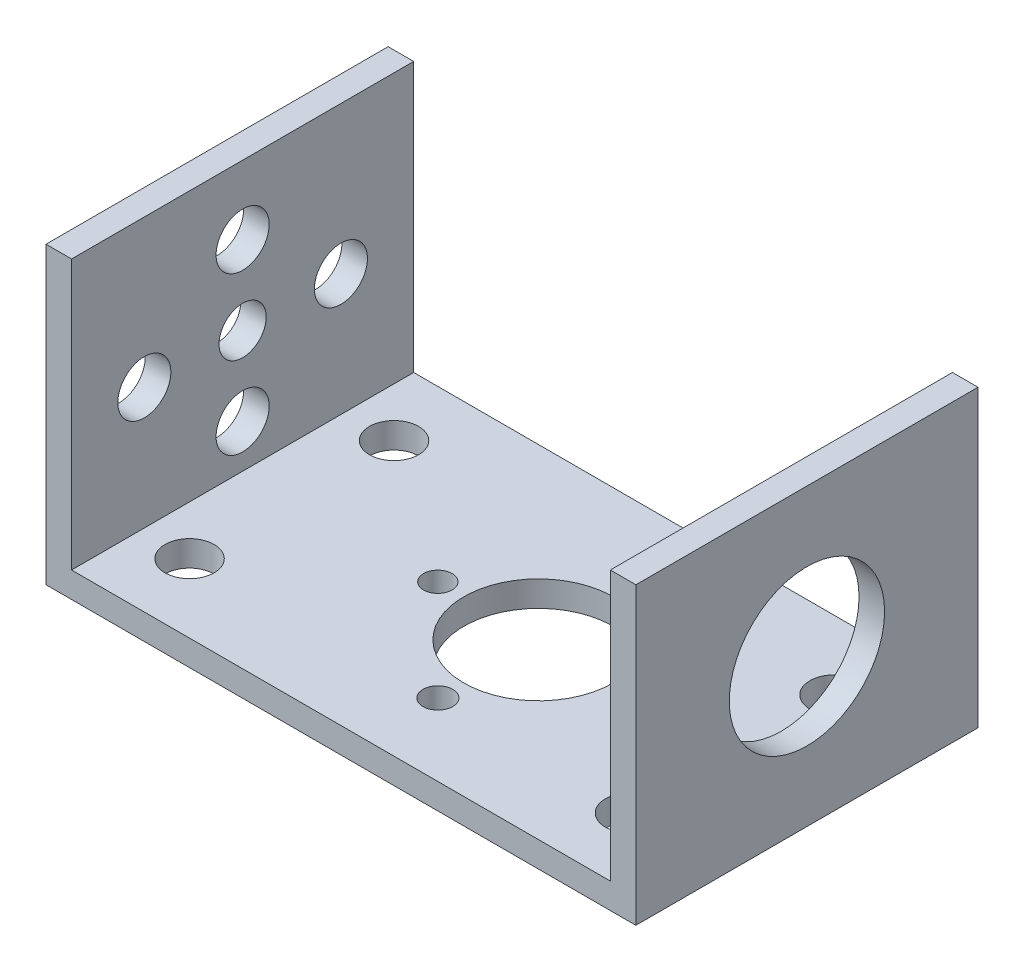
ISO-10303-21;
HEADER;
FILE_DESCRIPTION(('STEP AP214'),'2;1');
FILE_NAME('part.step','',(''),(''),'','','');
FILE_SCHEMA(('AUTOMOTIVE_DESIGN { 1 0 10303 214 1 1 1 1 }'));
ENDSEC;
DATA;
#1=APPLICATION_CONTEXT('core data for automotive mechanical design processes');
#2=APPLICATION_PROTOCOL_DEFINITION('international standard','automotive_design',2000,#1);
#3=PRODUCT_CONTEXT('',#1,'mechanical');
#4=PRODUCT('Part','Part','',(#3));
#5=PRODUCT_RELATED_PRODUCT_CATEGORY('part','',(#4));
#6=PRODUCT_DEFINITION_FORMATION('','',#4);
#7=PRODUCT_DEFINITION_CONTEXT('part definition',#1,'design');
#8=PRODUCT_DEFINITION('design','',#6,#7);
#9=PRODUCT_DEFINITION_SHAPE('','',#8);
#10=(LENGTH_UNIT() NAMED_UNIT(*) SI_UNIT(.MILLI.,.METRE.));
#11=(NAMED_UNIT(*) PLANE_ANGLE_UNIT() SI_UNIT($,.RADIAN.));
#12=(NAMED_UNIT(*) SI_UNIT($,.STERADIAN.) SOLID_ANGLE_UNIT());
#13=UNCERTAINTY_MEASURE_WITH_UNIT(LENGTH_MEASURE(1.E-05),#10,'distance_accuracy_value','');
#14=(GEOMETRIC_REPRESENTATION_CONTEXT(3) GLOBAL_UNCERTAINTY_ASSIGNED_CONTEXT((#13)) GLOBAL_UNIT_ASSIGNED_CONTEXT((#10,
#11,#12)) REPRESENTATION_CONTEXT('',''));
#15=CARTESIAN_POINT('',(0.,0.,0.));
#16=DIRECTION('',(0.,0.,1.));
#17=DIRECTION('',(1.,0.,0.));
#18=AXIS2_PLACEMENT_3D('',#15,#16,#17);
#19=CARTESIAN_POINT('',(-37.3660245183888,16.6367775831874,44.196));
#20=DIRECTION('',(0.,-1.,0.));
#21=DIRECTION('',(0.,0.,-1.));
#22=AXIS2_PLACEMENT_3D('',#19,#20,#21);
#23=PLANE('',#22);
#24=DIRECTION('',(-1.,0.,0.));
#25=VECTOR('',#24,1.);
#26=CARTESIAN_POINT('',(-37.3660245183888,16.6367775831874,0.));
#27=LINE('',#26,#25);
#28=CARTESIAN_POINT('',(-34.0640245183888,16.6367775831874,0.));
#29=VERTEX_POINT('',#28);
#30=CARTESIAN_POINT('',(-37.3660245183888,16.6367775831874,0.));
#31=VERTEX_POINT('',#30);
#32=EDGE_CURVE('E130',#29,#31,#27,.T.);
#33=ORIENTED_EDGE('',*,*,#32,.T.);
#34=DIRECTION('',(0.,0.,-1.));
#35=VECTOR('',#34,1.);
#36=CARTESIAN_POINT('',(-37.3660245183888,16.6367775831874,44.196));
#37=LINE('',#36,#35);
#38=CARTESIAN_POINT('',(-37.3660245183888,16.6367775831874,44.196));
#39=VERTEX_POINT('',#38);
#40=EDGE_CURVE('E11',#39,#31,#37,.T.);
#41=ORIENTED_EDGE('',*,*,#40,.F.);
#42=DIRECTION('',(-1.,0.,0.));
#43=VECTOR('',#42,1.);
#44=CARTESIAN_POINT('',(-37.3660245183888,16.6367775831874,44.196));
#45=LINE('',#44,#43);
#46=CARTESIAN_POINT('',(-34.0640245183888,16.6367775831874,44.196));
#47=VERTEX_POINT('',#46);
#48=EDGE_CURVE('E145',#47,#39,#45,.T.);
#49=ORIENTED_EDGE('',*,*,#48,.F.);
#50=DIRECTION('',(0.,0.,-1.));
#51=VECTOR('',#50,1.);
#52=CARTESIAN_POINT('',(-34.0640245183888,16.6367775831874,44.196));
#53=LINE('',#52,#51);
#54=EDGE_CURVE('E126',#47,#29,#53,.T.);
#55=ORIENTED_EDGE('',*,*,#54,.T.);
#56=EDGE_LOOP('',(#33,#41,#49,#55));
#57=FACE_BOUND('',#56,.T.);
#58=ADVANCED_FACE('F32',(#57),#23,.F.);
#59=CARTESIAN_POINT('',(-37.3660245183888,16.6367775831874,44.196));
#60=DIRECTION('',(1.,0.,0.));
#61=DIRECTION('',(0.,0.,-1.));
#62=AXIS2_PLACEMENT_3D('',#59,#60,#61);
#63=PLANE('',#62);
#64=CARTESIAN_POINT('',(-37.3660245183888,-2.41322241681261,9.398));
#65=DIRECTION('',(-1.,0.,0.));
#66=DIRECTION('',(0.,0.,1.));
#67=AXIS2_PLACEMENT_3D('',#64,#65,#66);
#68=CIRCLE('',#67,3.429);
#69=CARTESIAN_POINT('',(-37.3660245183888,-2.41322241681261,12.827));
#70=VERTEX_POINT('',#69);
#71=EDGE_CURVE('E183',#70,#70,#68,.T.);
#72=ORIENTED_EDGE('',*,*,#71,.F.);
#73=EDGE_LOOP('',(#72));
#74=FACE_BOUND('',#73,.T.);
#75=CARTESIAN_POINT('',(-37.3660245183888,-12.5732224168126,22.098));
#76=DIRECTION('',(-1.,0.,0.));
#77=DIRECTION('',(0.,0.,1.));
#78=AXIS2_PLACEMENT_3D('',#75,#76,#77);
#79=CIRCLE('',#78,3.429);
#80=CARTESIAN_POINT('',(-37.3660245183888,-12.5732224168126,25.527));
#81=VERTEX_POINT('',#80);
#82=EDGE_CURVE('E179',#81,#81,#79,.T.);
#83=ORIENTED_EDGE('',*,*,#82,.F.);
#84=EDGE_LOOP('',(#83));
#85=FACE_BOUND('',#84,.T.);
#86=CARTESIAN_POINT('',(-37.3660245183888,-2.41322241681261,34.798));
#87=DIRECTION('',(-1.,0.,0.));
#88=DIRECTION('',(0.,0.,1.));
#89=AXIS2_PLACEMENT_3D('',#86,#87,#88);
#90=CIRCLE('',#89,3.429);
#91=CARTESIAN_POINT('',(-37.3660245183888,-2.41322241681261,38.227));
#92=VERTEX_POINT('',#91);
#93=EDGE_CURVE('E175',#92,#92,#90,.T.);
#94=ORIENTED_EDGE('',*,*,#93,.F.);
#95=EDGE_LOOP('',(#94));
#96=FACE_BOUND('',#95,.T.);
#97=CARTESIAN_POINT('',(-37.3660245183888,7.74677758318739,22.098));
#98=DIRECTION('',(-1.,0.,0.));
#99=DIRECTION('',(0.,0.,1.));
#100=AXIS2_PLACEMENT_3D('',#97,#98,#99);
#101=CIRCLE('',#100,3.429);
#102=CARTESIAN_POINT('',(-37.3660245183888,7.74677758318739,25.527));
#103=VERTEX_POINT('',#102);
#104=EDGE_CURVE('E171',#103,#103,#101,.T.);
#105=ORIENTED_EDGE('',*,*,#104,.F.);
#106=EDGE_LOOP('',(#105));
#107=FACE_BOUND('',#106,.T.);
#108=CARTESIAN_POINT('',(-37.3660245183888,-2.41322241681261,22.098));
#109=DIRECTION('',(-1.,0.,0.));
#110=DIRECTION('',(0.,0.,1.));
#111=AXIS2_PLACEMENT_3D('',#108,#109,#110);
#112=CIRCLE('',#111,3.048);
#113=CARTESIAN_POINT('',(-37.3660245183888,-2.41322241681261,25.146));
#114=VERTEX_POINT('',#113);
#115=EDGE_CURVE('E163',#114,#114,#112,.T.);
#116=ORIENTED_EDGE('',*,*,#115,.F.);
#117=EDGE_LOOP('',(#116));
#118=FACE_BOUND('',#117,.T.);
#119=DIRECTION('',(0.,-1.,0.));
#120=VECTOR('',#119,1.);
#121=CARTESIAN_POINT('',(-37.3660245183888,16.6367775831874,0.));
#122=LINE('',#121,#120);
#123=CARTESIAN_POINT('',(-37.3660245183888,-21.4632224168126,0.));
#124=VERTEX_POINT('',#123);
#125=EDGE_CURVE('E133',#31,#124,#122,.T.);
#126=ORIENTED_EDGE('',*,*,#125,.T.);
#127=DIRECTION('',(0.,0.,-1.));
#128=VECTOR('',#127,1.);
#129=CARTESIAN_POINT('',(-37.3660245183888,-21.4632224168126,44.196));
#130=LINE('',#129,#128);
#131=CARTESIAN_POINT('',(-37.3660245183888,-21.4632224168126,44.196));
#132=VERTEX_POINT('',#131);
#133=EDGE_CURVE('E41',#132,#124,#130,.T.);
#134=ORIENTED_EDGE('',*,*,#133,.F.);
#135=DIRECTION('',(0.,-1.,0.));
#136=VECTOR('',#135,1.);
#137=CARTESIAN_POINT('',(-37.3660245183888,16.6367775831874,44.196));
#138=LINE('',#137,#136);
#139=EDGE_CURVE('E93',#39,#132,#138,.T.);
#140=ORIENTED_EDGE('',*,*,#139,.F.);
#141=ORIENTED_EDGE('',*,*,#40,.T.);
#142=EDGE_LOOP('',(#126,#134,#140,#141));
#143=FACE_BOUND('',#142,.T.);
#144=ADVANCED_FACE('F282',(#74,#85,#96,#107,#118,#143),#63,.F.);
#145=CARTESIAN_POINT('',(-37.3660245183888,-21.4632224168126,44.196));
#146=DIRECTION('',(0.,1.,0.));
#147=DIRECTION('',(-1.,0.,0.));
#148=AXIS2_PLACEMENT_3D('',#145,#146,#147);
#149=PLANE('',#148);
#150=CARTESIAN_POINT('',(3.90897548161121,-21.4632224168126,8.85107137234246));
#151=DIRECTION('',(0.,-1.,0.));
#152=DIRECTION('',(1.,0.,0.));
#153=AXIS2_PLACEMENT_3D('',#150,#151,#152);
#154=CIRCLE('',#153,1.65245260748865);
#155=CARTESIAN_POINT('',(5.56142808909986,-21.4632224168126,8.85107137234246));
#156=VERTEX_POINT('',#155);
#157=EDGE_CURVE('E204',#156,#156,#154,.T.);
#158=ORIENTED_EDGE('',*,*,#157,.F.);
#159=EDGE_LOOP('',(#158));
#160=FACE_BOUND('',#159,.T.);
#161=CARTESIAN_POINT('',(16.9089754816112,-21.4632224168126,21.8510713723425));
#162=DIRECTION('',(0.,-1.,0.));
#163=DIRECTION('',(1.,0.,0.));
#164=AXIS2_PLACEMENT_3D('',#161,#162,#163);
#165=CIRCLE('',#164,1.79902171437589);
#166=CARTESIAN_POINT('',(18.7079971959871,-21.4632224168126,21.8510713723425));
#167=VERTEX_POINT('',#166);
#168=EDGE_CURVE('E194',#167,#167,#165,.T.);
#169=ORIENTED_EDGE('',*,*,#168,.F.);
#170=EDGE_LOOP('',(#169));
#171=FACE_BOUND('',#170,.T.);
#172=CARTESIAN_POINT('',(3.90897548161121,-21.4632224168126,34.8510713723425));
#173=DIRECTION('',(0.,-1.,0.));
#174=DIRECTION('',(1.,0.,0.));
#175=AXIS2_PLACEMENT_3D('',#172,#173,#174);
#176=CIRCLE('',#175,1.92604116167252);
#177=CARTESIAN_POINT('',(5.83501664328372,-21.4632224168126,34.8510713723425));
#178=VERTEX_POINT('',#177);
#179=EDGE_CURVE('E191',#178,#178,#176,.T.);
#180=ORIENTED_EDGE('',*,*,#179,.F.);
#181=EDGE_LOOP('',(#180));
#182=FACE_BOUND('',#181,.T.);
#183=CARTESIAN_POINT('',(-9.09102451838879,-21.4632224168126,21.8510713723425));
#184=DIRECTION('',(0.,-1.,0.));
#185=DIRECTION('',(1.,0.,0.));
#186=AXIS2_PLACEMENT_3D('',#183,#184,#185);
#187=CIRCLE('',#186,1.84460575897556);
#188=CARTESIAN_POINT('',(-7.24641875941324,-21.4632224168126,21.8510713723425));
#189=VERTEX_POINT('',#188);
#190=EDGE_CURVE('E188',#189,#189,#187,.T.);
#191=ORIENTED_EDGE('',*,*,#190,.F.);
#192=EDGE_LOOP('',(#191));
#193=FACE_BOUND('',#192,.T.);
#194=CARTESIAN_POINT('',(-27.7140245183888,-21.4632224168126,35.306));
#195=DIRECTION('',(0.,1.,0.));
#196=DIRECTION('',(-1.,0.,0.));
#197=AXIS2_PLACEMENT_3D('',#194,#195,#196);
#198=CIRCLE('',#197,3.175);
#199=CARTESIAN_POINT('',(-30.8890245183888,-21.4632224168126,35.306));
#200=VERTEX_POINT('',#199);
#201=EDGE_CURVE('E211',#200,#200,#198,.T.);
#202=ORIENTED_EDGE('',*,*,#201,.T.);
#203=EDGE_LOOP('',(#202));
#204=FACE_BOUND('',#203,.T.);
#205=CARTESIAN_POINT('',(-27.7140245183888,-21.4632224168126,8.89));
#206=DIRECTION('',(0.,1.,0.));
#207=DIRECTION('',(-1.,0.,0.));
#208=AXIS2_PLACEMENT_3D('',#205,#206,#207);
#209=CIRCLE('',#208,3.175);
#210=CARTESIAN_POINT('',(-30.8890245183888,-21.4632224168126,8.89));
#211=VERTEX_POINT('',#210);
#212=EDGE_CURVE('E217',#211,#211,#209,.T.);
#213=ORIENTED_EDGE('',*,*,#212,.T.);
#214=EDGE_LOOP('',(#213));
#215=FACE_BOUND('',#214,.T.);
#216=CARTESIAN_POINT('',(29.1819754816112,-21.4632224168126,35.306));
#217=DIRECTION('',(0.,1.,0.));
#218=DIRECTION('',(-1.,0.,0.));
#219=AXIS2_PLACEMENT_3D('',#216,#217,#218);
#220=CIRCLE('',#219,3.175);
#221=CARTESIAN_POINT('',(26.0069754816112,-21.4632224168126,35.306));
#222=VERTEX_POINT('',#221);
#223=EDGE_CURVE('E223',#222,#222,#220,.T.);
#224=ORIENTED_EDGE('',*,*,#223,.T.);
#225=EDGE_LOOP('',(#224));
#226=FACE_BOUND('',#225,.T.);
#227=CARTESIAN_POINT('',(29.1819754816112,-21.4632224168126,8.89));
#228=DIRECTION('',(0.,1.,0.));
#229=DIRECTION('',(-1.,0.,0.));
#230=AXIS2_PLACEMENT_3D('',#227,#228,#229);
#231=CIRCLE('',#230,3.175);
#232=CARTESIAN_POINT('',(26.0069754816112,-21.4632224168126,8.89));
#233=VERTEX_POINT('',#232);
#234=EDGE_CURVE('E229',#233,#233,#231,.T.);
#235=ORIENTED_EDGE('',*,*,#234,.T.);
#236=EDGE_LOOP('',(#235));
#237=FACE_BOUND('',#236,.T.);
#238=CARTESIAN_POINT('',(3.90897548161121,-21.4632224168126,21.8510713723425));
#239=DIRECTION('',(0.,-1.,0.));
#240=DIRECTION('',(1.,0.,0.));
#241=AXIS2_PLACEMENT_3D('',#238,#239,#240);
#242=CIRCLE('',#241,9.65);
#243=CARTESIAN_POINT('',(13.5589754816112,-21.4632224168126,21.8510713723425));
#244=VERTEX_POINT('',#243);
#245=EDGE_CURVE('E159',#244,#244,#242,.T.);
#246=ORIENTED_EDGE('',*,*,#245,.F.);
#247=EDGE_LOOP('',(#246));
#248=FACE_BOUND('',#247,.T.);
#249=DIRECTION('',(1.,0.,0.));
#250=VECTOR('',#249,1.);
#251=CARTESIAN_POINT('',(-37.3660245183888,-21.4632224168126,0.));
#252=LINE('',#251,#250);
#253=CARTESIAN_POINT('',(38.8339754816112,-21.4632224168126,0.));
#254=VERTEX_POINT('',#253);
#255=EDGE_CURVE('E136',#124,#254,#252,.T.);
#256=ORIENTED_EDGE('',*,*,#255,.T.);
#257=DIRECTION('',(0.,0.,-1.));
#258=VECTOR('',#257,1.);
#259=CARTESIAN_POINT('',(38.8339754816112,-21.4632224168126,44.196));
#260=LINE('',#259,#258);
#261=CARTESIAN_POINT('',(38.8339754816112,-21.4632224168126,44.196));
#262=VERTEX_POINT('',#261);
#263=EDGE_CURVE('E152',#262,#254,#260,.T.);
#264=ORIENTED_EDGE('',*,*,#263,.F.);
#265=DIRECTION('',(1.,0.,0.));
#266=VECTOR('',#265,1.);
#267=CARTESIAN_POINT('',(-37.3660245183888,-21.4632224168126,44.196));
#268=LINE('',#267,#266);
#269=EDGE_CURVE('E248',#132,#262,#268,.T.);
#270=ORIENTED_EDGE('',*,*,#269,.F.);
#271=ORIENTED_EDGE('',*,*,#133,.T.);
#272=EDGE_LOOP('',(#256,#264,#270,#271));
#273=FACE_BOUND('',#272,.T.);
#274=ADVANCED_FACE('F286',(#160,#171,#182,#193,#204,#215,#226,#237,#248,#273),#149,.F.);
#275=CARTESIAN_POINT('',(38.8339754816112,-21.4632224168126,44.196));
#276=DIRECTION('',(-1.,0.,0.));
#277=DIRECTION('',(0.,0.,1.));
#278=AXIS2_PLACEMENT_3D('',#275,#276,#277);
#279=PLANE('',#278);
#280=CARTESIAN_POINT('',(38.8339754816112,-2.41322241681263,22.098));
#281=DIRECTION('',(1.,0.,0.));
#282=DIRECTION('',(0.,0.,-1.));
#283=AXIS2_PLACEMENT_3D('',#280,#281,#282);
#284=CIRCLE('',#283,10.033);
#285=CARTESIAN_POINT('',(38.8339754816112,-2.41322241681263,12.065));
#286=VERTEX_POINT('',#285);
#287=EDGE_CURVE('E167',#286,#286,#284,.T.);
#288=ORIENTED_EDGE('',*,*,#287,.F.);
#289=EDGE_LOOP('',(#288));
#290=FACE_BOUND('',#289,.T.);
#291=DIRECTION('',(0.,1.,0.));
#292=VECTOR('',#291,1.);
#293=CARTESIAN_POINT('',(38.8339754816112,-21.4632224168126,0.));
#294=LINE('',#293,#292);
#295=CARTESIAN_POINT('',(38.8339754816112,16.6367775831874,0.));
#296=VERTEX_POINT('',#295);
#297=EDGE_CURVE('E138',#254,#296,#294,.T.);
#298=ORIENTED_EDGE('',*,*,#297,.T.);
#299=DIRECTION('',(0.,0.,-1.));
#300=VECTOR('',#299,1.);
#301=CARTESIAN_POINT('',(38.8339754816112,16.6367775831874,44.196));
#302=LINE('',#301,#300);
#303=CARTESIAN_POINT('',(38.8339754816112,16.6367775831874,44.196));
#304=VERTEX_POINT('',#303);
#305=EDGE_CURVE('E149',#304,#296,#302,.T.);
#306=ORIENTED_EDGE('',*,*,#305,.F.);
#307=DIRECTION('',(0.,1.,0.));
#308=VECTOR('',#307,1.);
#309=CARTESIAN_POINT('',(38.8339754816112,-21.4632224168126,44.196));
#310=LINE('',#309,#308);
#311=EDGE_CURVE('E250',#262,#304,#310,.T.);
#312=ORIENTED_EDGE('',*,*,#311,.F.);
#313=ORIENTED_EDGE('',*,*,#263,.T.);
#314=EDGE_LOOP('',(#298,#306,#312,#313));
#315=FACE_BOUND('',#314,.T.);
#316=ADVANCED_FACE('F256',(#290,#315),#279,.F.);
#317=CARTESIAN_POINT('',(38.8339754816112,16.6367775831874,44.196));
#318=DIRECTION('',(0.,-1.,0.));
#319=DIRECTION('',(0.,0.,-1.));
#320=AXIS2_PLACEMENT_3D('',#317,#318,#319);
#321=PLANE('',#320);
#322=DIRECTION('',(-1.,0.,0.));
#323=VECTOR('',#322,1.);
#324=CARTESIAN_POINT('',(38.8339754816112,16.6367775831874,0.));
#325=LINE('',#324,#323);
#326=CARTESIAN_POINT('',(35.5319754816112,16.6367775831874,0.));
#327=VERTEX_POINT('',#326);
#328=EDGE_CURVE('E140',#296,#327,#325,.T.);
#329=ORIENTED_EDGE('',*,*,#328,.T.);
#330=DIRECTION('',(0.,0.,-1.));
#331=VECTOR('',#330,1.);
#332=CARTESIAN_POINT('',(35.5319754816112,16.6367775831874,44.196));
#333=LINE('',#332,#331);
#334=CARTESIAN_POINT('',(35.5319754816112,16.6367775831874,44.196));
#335=VERTEX_POINT('',#334);
#336=EDGE_CURVE('E121',#335,#327,#333,.T.);
#337=ORIENTED_EDGE('',*,*,#336,.F.);
#338=DIRECTION('',(-1.,0.,0.));
#339=VECTOR('',#338,1.);
#340=CARTESIAN_POINT('',(38.8339754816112,16.6367775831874,44.196));
#341=LINE('',#340,#339);
#342=EDGE_CURVE('E112',#304,#335,#341,.T.);
#343=ORIENTED_EDGE('',*,*,#342,.F.);
#344=ORIENTED_EDGE('',*,*,#305,.T.);
#345=EDGE_LOOP('',(#329,#337,#343,#344));
#346=FACE_BOUND('',#345,.T.);
#347=ADVANCED_FACE('F260',(#346),#321,.F.);
#348=CARTESIAN_POINT('',(35.5319754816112,16.6367775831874,44.196));
#349=DIRECTION('',(1.,0.,0.));
#350=DIRECTION('',(0.,1.,0.));
#351=AXIS2_PLACEMENT_3D('',#348,#349,#350);
#352=PLANE('',#351);
#353=CARTESIAN_POINT('',(35.5319754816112,-2.41322241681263,22.098));
#354=DIRECTION('',(1.,0.,0.));
#355=DIRECTION('',(0.,1.,0.));
#356=AXIS2_PLACEMENT_3D('',#353,#354,#355);
#357=CIRCLE('',#356,10.033);
#358=CARTESIAN_POINT('',(35.5319754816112,7.61977758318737,22.098));
#359=VERTEX_POINT('',#358);
#360=EDGE_CURVE('E164',#359,#359,#357,.T.);
#361=ORIENTED_EDGE('',*,*,#360,.T.);
#362=EDGE_LOOP('',(#361));
#363=FACE_BOUND('',#362,.T.);
#364=DIRECTION('',(0.,-1.,0.));
#365=VECTOR('',#364,1.);
#366=CARTESIAN_POINT('',(35.5319754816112,16.6367775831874,0.));
#367=LINE('',#366,#365);
#368=CARTESIAN_POINT('',(35.5319754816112,-18.1612224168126,0.));
#369=VERTEX_POINT('',#368);
#370=EDGE_CURVE('E120',#327,#369,#367,.T.);
#371=ORIENTED_EDGE('',*,*,#370,.T.);
#372=DIRECTION('',(0.,0.,-1.));
#373=VECTOR('',#372,1.);
#374=CARTESIAN_POINT('',(35.5319754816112,-18.1612224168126,44.196));
#375=LINE('',#374,#373);
#376=CARTESIAN_POINT('',(35.5319754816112,-18.1612224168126,44.196));
#377=VERTEX_POINT('',#376);
#378=EDGE_CURVE('E117',#377,#369,#375,.T.);
#379=ORIENTED_EDGE('',*,*,#378,.F.);
#380=DIRECTION('',(0.,-1.,0.));
#381=VECTOR('',#380,1.);
#382=CARTESIAN_POINT('',(35.5319754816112,16.6367775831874,44.196));
#383=LINE('',#382,#381);
#384=EDGE_CURVE('E106',#335,#377,#383,.T.);
#385=ORIENTED_EDGE('',*,*,#384,.F.);
#386=ORIENTED_EDGE('',*,*,#336,.T.);
#387=EDGE_LOOP('',(#371,#379,#385,#386));
#388=FACE_BOUND('',#387,.T.);
#389=ADVANCED_FACE('F118',(#363,#388),#352,.F.);
#390=CARTESIAN_POINT('',(-34.0640245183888,-18.1612224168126,44.196));
#391=DIRECTION('',(0.,-1.,0.));
#392=DIRECTION('',(1.,0.,0.));
#393=AXIS2_PLACEMENT_3D('',#390,#391,#392);
#394=PLANE('',#393);
#395=CARTESIAN_POINT('',(3.90897548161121,-18.1612224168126,8.85107137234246));
#396=DIRECTION('',(0.,-1.,0.));
#397=DIRECTION('',(1.,0.,0.));
#398=AXIS2_PLACEMENT_3D('',#395,#396,#397);
#399=CIRCLE('',#398,1.65245260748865);
#400=CARTESIAN_POINT('',(5.56142808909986,-18.1612224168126,8.85107137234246));
#401=VERTEX_POINT('',#400);
#402=EDGE_CURVE('E35',#401,#401,#399,.T.);
#403=ORIENTED_EDGE('',*,*,#402,.T.);
#404=EDGE_LOOP('',(#403));
#405=FACE_BOUND('',#404,.T.);
#406=CARTESIAN_POINT('',(16.9089754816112,-18.1612224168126,21.8510713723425));
#407=DIRECTION('',(0.,-1.,0.));
#408=DIRECTION('',(1.,0.,0.));
#409=AXIS2_PLACEMENT_3D('',#406,#407,#408);
#410=CIRCLE('',#409,1.79902171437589);
#411=CARTESIAN_POINT('',(18.7079971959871,-18.1612224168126,21.8510713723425));
#412=VERTEX_POINT('',#411);
#413=EDGE_CURVE('E192',#412,#412,#410,.T.);
#414=ORIENTED_EDGE('',*,*,#413,.T.);
#415=EDGE_LOOP('',(#414));
#416=FACE_BOUND('',#415,.T.);
#417=CARTESIAN_POINT('',(3.90897548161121,-18.1612224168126,34.8510713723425));
#418=DIRECTION('',(0.,-1.,0.));
#419=DIRECTION('',(1.,0.,0.));
#420=AXIS2_PLACEMENT_3D('',#417,#418,#419);
#421=CIRCLE('',#420,1.92604116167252);
#422=CARTESIAN_POINT('',(5.83501664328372,-18.1612224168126,34.8510713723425));
#423=VERTEX_POINT('',#422);
#424=EDGE_CURVE('E189',#423,#423,#421,.T.);
#425=ORIENTED_EDGE('',*,*,#424,.T.);
#426=EDGE_LOOP('',(#425));
#427=FACE_BOUND('',#426,.T.);
#428=CARTESIAN_POINT('',(-9.09102451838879,-18.1612224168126,21.8510713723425));
#429=DIRECTION('',(0.,-1.,0.));
#430=DIRECTION('',(1.,0.,0.));
#431=AXIS2_PLACEMENT_3D('',#428,#429,#430);
#432=CIRCLE('',#431,1.84460575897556);
#433=CARTESIAN_POINT('',(-7.24641875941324,-18.1612224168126,21.8510713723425));
#434=VERTEX_POINT('',#433);
#435=EDGE_CURVE('E184',#434,#434,#432,.T.);
#436=ORIENTED_EDGE('',*,*,#435,.T.);
#437=EDGE_LOOP('',(#436));
#438=FACE_BOUND('',#437,.T.);
#439=CARTESIAN_POINT('',(-27.7140245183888,-18.1612224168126,35.306));
#440=DIRECTION('',(0.,1.,0.));
#441=DIRECTION('',(-1.,0.,0.));
#442=AXIS2_PLACEMENT_3D('',#439,#440,#441);
#443=CIRCLE('',#442,3.175);
#444=CARTESIAN_POINT('',(-30.8890245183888,-18.1612224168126,35.306));
#445=VERTEX_POINT('',#444);
#446=EDGE_CURVE('E187',#445,#445,#443,.T.);
#447=ORIENTED_EDGE('',*,*,#446,.F.);
#448=EDGE_LOOP('',(#447));
#449=FACE_BOUND('',#448,.T.);
#450=CARTESIAN_POINT('',(-27.7140245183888,-18.1612224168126,8.89));
#451=DIRECTION('',(0.,1.,0.));
#452=DIRECTION('',(-1.,0.,0.));
#453=AXIS2_PLACEMENT_3D('',#450,#451,#452);
#454=CIRCLE('',#453,3.175);
#455=CARTESIAN_POINT('',(-30.8890245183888,-18.1612224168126,8.89));
#456=VERTEX_POINT('',#455);
#457=EDGE_CURVE('E214',#456,#456,#454,.T.);
#458=ORIENTED_EDGE('',*,*,#457,.F.);
#459=EDGE_LOOP('',(#458));
#460=FACE_BOUND('',#459,.T.);
#461=CARTESIAN_POINT('',(29.1819754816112,-18.1612224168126,35.306));
#462=DIRECTION('',(0.,1.,0.));
#463=DIRECTION('',(-1.,0.,0.));
#464=AXIS2_PLACEMENT_3D('',#461,#462,#463);
#465=CIRCLE('',#464,3.175);
#466=CARTESIAN_POINT('',(26.0069754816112,-18.1612224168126,35.306));
#467=VERTEX_POINT('',#466);
#468=EDGE_CURVE('E220',#467,#467,#465,.T.);
#469=ORIENTED_EDGE('',*,*,#468,.F.);
#470=EDGE_LOOP('',(#469));
#471=FACE_BOUND('',#470,.T.);
#472=CARTESIAN_POINT('',(29.1819754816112,-18.1612224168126,8.89));
#473=DIRECTION('',(0.,1.,0.));
#474=DIRECTION('',(-1.,0.,0.));
#475=AXIS2_PLACEMENT_3D('',#472,#473,#474);
#476=CIRCLE('',#475,3.175);
#477=CARTESIAN_POINT('',(26.0069754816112,-18.1612224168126,8.89));
#478=VERTEX_POINT('',#477);
#479=EDGE_CURVE('E226',#478,#478,#476,.T.);
#480=ORIENTED_EDGE('',*,*,#479,.F.);
#481=EDGE_LOOP('',(#480));
#482=FACE_BOUND('',#481,.T.);
#483=CARTESIAN_POINT('',(3.90897548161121,-18.1612224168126,21.8510713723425));
#484=DIRECTION('',(0.,-1.,0.));
#485=DIRECTION('',(1.,0.,0.));
#486=AXIS2_PLACEMENT_3D('',#483,#484,#485);
#487=CIRCLE('',#486,9.65);
#488=CARTESIAN_POINT('',(13.5589754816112,-18.1612224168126,21.8510713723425));
#489=VERTEX_POINT('',#488);
#490=EDGE_CURVE('E134',#489,#489,#487,.T.);
#491=ORIENTED_EDGE('',*,*,#490,.T.);
#492=EDGE_LOOP('',(#491));
#493=FACE_BOUND('',#492,.T.);
#494=DIRECTION('',(-1.,0.,0.));
#495=VECTOR('',#494,1.);
#496=CARTESIAN_POINT('',(-34.0640245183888,-18.1612224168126,0.));
#497=LINE('',#496,#495);
#498=CARTESIAN_POINT('',(-34.0640245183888,-18.1612224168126,0.));
#499=VERTEX_POINT('',#498);
#500=EDGE_CURVE('E79',#369,#499,#497,.T.);
#501=ORIENTED_EDGE('',*,*,#500,.T.);
#502=DIRECTION('',(0.,0.,-1.));
#503=VECTOR('',#502,1.);
#504=CARTESIAN_POINT('',(-34.0640245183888,-18.1612224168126,44.196));
#505=LINE('',#504,#503);
#506=CARTESIAN_POINT('',(-34.0640245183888,-18.1612224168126,44.196));
#507=VERTEX_POINT('',#506);
#508=EDGE_CURVE('E122',#507,#499,#505,.T.);
#509=ORIENTED_EDGE('',*,*,#508,.F.);
#510=DIRECTION('',(-1.,0.,0.));
#511=VECTOR('',#510,1.);
#512=CARTESIAN_POINT('',(-34.0640245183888,-18.1612224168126,44.196));
#513=LINE('',#512,#511);
#514=EDGE_CURVE('E110',#377,#507,#513,.T.);
#515=ORIENTED_EDGE('',*,*,#514,.F.);
#516=ORIENTED_EDGE('',*,*,#378,.T.);
#517=EDGE_LOOP('',(#501,#509,#515,#516));
#518=FACE_BOUND('',#517,.T.);
#519=ADVANCED_FACE('F124',(#405,#416,#427,#438,#449,#460,#471,#482,#493,#518),#394,.F.);
#520=CARTESIAN_POINT('',(-34.0640245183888,16.6367775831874,44.196));
#521=DIRECTION('',(-1.,0.,0.));
#522=DIRECTION('',(0.,-1.,0.));
#523=AXIS2_PLACEMENT_3D('',#520,#521,#522);
#524=PLANE('',#523);
#525=CARTESIAN_POINT('',(-34.0640245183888,-2.41322241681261,9.398));
#526=DIRECTION('',(-1.,0.,0.));
#527=DIRECTION('',(0.,-1.,0.));
#528=AXIS2_PLACEMENT_3D('',#525,#526,#527);
#529=CIRCLE('',#528,3.429);
#530=CARTESIAN_POINT('',(-34.0640245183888,-5.84222241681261,9.398));
#531=VERTEX_POINT('',#530);
#532=EDGE_CURVE('E180',#531,#531,#529,.T.);
#533=ORIENTED_EDGE('',*,*,#532,.T.);
#534=EDGE_LOOP('',(#533));
#535=FACE_BOUND('',#534,.T.);
#536=CARTESIAN_POINT('',(-34.0640245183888,-12.5732224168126,22.098));
#537=DIRECTION('',(-1.,0.,0.));
#538=DIRECTION('',(0.,-1.,0.));
#539=AXIS2_PLACEMENT_3D('',#536,#537,#538);
#540=CIRCLE('',#539,3.429);
#541=CARTESIAN_POINT('',(-34.0640245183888,-16.0022224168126,22.098));
#542=VERTEX_POINT('',#541);
#543=EDGE_CURVE('E176',#542,#542,#540,.T.);
#544=ORIENTED_EDGE('',*,*,#543,.T.);
#545=EDGE_LOOP('',(#544));
#546=FACE_BOUND('',#545,.T.);
#547=CARTESIAN_POINT('',(-34.0640245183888,-2.41322241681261,34.798));
#548=DIRECTION('',(-1.,0.,0.));
#549=DIRECTION('',(0.,-1.,0.));
#550=AXIS2_PLACEMENT_3D('',#547,#548,#549);
#551=CIRCLE('',#550,3.429);
#552=CARTESIAN_POINT('',(-34.0640245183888,-5.84222241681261,34.798));
#553=VERTEX_POINT('',#552);
#554=EDGE_CURVE('E172',#553,#553,#551,.T.);
#555=ORIENTED_EDGE('',*,*,#554,.T.);
#556=EDGE_LOOP('',(#555));
#557=FACE_BOUND('',#556,.T.);
#558=CARTESIAN_POINT('',(-34.0640245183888,7.74677758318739,22.098));
#559=DIRECTION('',(-1.,0.,0.));
#560=DIRECTION('',(0.,-1.,0.));
#561=AXIS2_PLACEMENT_3D('',#558,#559,#560);
#562=CIRCLE('',#561,3.429);
#563=CARTESIAN_POINT('',(-34.0640245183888,4.31777758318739,22.098));
#564=VERTEX_POINT('',#563);
#565=EDGE_CURVE('E168',#564,#564,#562,.T.);
#566=ORIENTED_EDGE('',*,*,#565,.T.);
#567=EDGE_LOOP('',(#566));
#568=FACE_BOUND('',#567,.T.);
#569=CARTESIAN_POINT('',(-34.0640245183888,-2.41322241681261,22.098));
#570=DIRECTION('',(-1.,0.,0.));
#571=DIRECTION('',(0.,-1.,0.));
#572=AXIS2_PLACEMENT_3D('',#569,#570,#571);
#573=CIRCLE('',#572,3.048);
#574=CARTESIAN_POINT('',(-34.0640245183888,-5.46122241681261,22.098));
#575=VERTEX_POINT('',#574);
#576=EDGE_CURVE('E160',#575,#575,#573,.T.);
#577=ORIENTED_EDGE('',*,*,#576,.T.);
#578=EDGE_LOOP('',(#577));
#579=FACE_BOUND('',#578,.T.);
#580=DIRECTION('',(0.,1.,0.));
#581=VECTOR('',#580,1.);
#582=CARTESIAN_POINT('',(-34.0640245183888,16.6367775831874,0.));
#583=LINE('',#582,#581);
#584=EDGE_CURVE('E85',#499,#29,#583,.T.);
#585=ORIENTED_EDGE('',*,*,#584,.T.);
#586=ORIENTED_EDGE('',*,*,#54,.F.);
#587=DIRECTION('',(0.,1.,0.));
#588=VECTOR('',#587,1.);
#589=CARTESIAN_POINT('',(-34.0640245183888,16.6367775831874,44.196));
#590=LINE('',#589,#588);
#591=EDGE_CURVE('E50',#507,#47,#590,.T.);
#592=ORIENTED_EDGE('',*,*,#591,.F.);
#593=ORIENTED_EDGE('',*,*,#508,.T.);
#594=EDGE_LOOP('',(#585,#586,#592,#593));
#595=FACE_BOUND('',#594,.T.);
#596=ADVANCED_FACE('F268',(#535,#546,#557,#568,#579,#595),#524,.F.);
#597=CARTESIAN_POINT('',(0.,0.,44.196));
#598=DIRECTION('',(0.,0.,-1.));
#599=DIRECTION('',(-1.,0.,0.));
#600=AXIS2_PLACEMENT_3D('',#597,#598,#599);
#601=PLANE('',#600);
#602=ORIENTED_EDGE('',*,*,#48,.T.);
#603=ORIENTED_EDGE('',*,*,#139,.T.);
#604=ORIENTED_EDGE('',*,*,#269,.T.);
#605=ORIENTED_EDGE('',*,*,#311,.T.);
#606=ORIENTED_EDGE('',*,*,#342,.T.);
#607=ORIENTED_EDGE('',*,*,#384,.T.);
#608=ORIENTED_EDGE('',*,*,#514,.T.);
#609=ORIENTED_EDGE('',*,*,#591,.T.);
#610=EDGE_LOOP('',(#602,#603,#604,#605,#606,#607,#608,#609));
#611=FACE_BOUND('',#610,.T.);
#612=ADVANCED_FACE('F108',(#611),#601,.F.);
#613=CARTESIAN_POINT('',(0.,0.,0.));
#614=DIRECTION('',(0.,0.,-1.));
#615=DIRECTION('',(-1.,0.,0.));
#616=AXIS2_PLACEMENT_3D('',#613,#614,#615);
#617=PLANE('',#616);
#618=ORIENTED_EDGE('',*,*,#32,.F.);
#619=ORIENTED_EDGE('',*,*,#584,.F.);
#620=ORIENTED_EDGE('',*,*,#500,.F.);
#621=ORIENTED_EDGE('',*,*,#370,.F.);
#622=ORIENTED_EDGE('',*,*,#328,.F.);
#623=ORIENTED_EDGE('',*,*,#297,.F.);
#624=ORIENTED_EDGE('',*,*,#255,.F.);
#625=ORIENTED_EDGE('',*,*,#125,.F.);
#626=EDGE_LOOP('',(#618,#619,#620,#621,#622,#623,#624,#625));
#627=FACE_BOUND('',#626,.T.);
#628=ADVANCED_FACE('F263',(#627),#617,.T.);
#629=CARTESIAN_POINT('',(3.90897548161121,38.9887775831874,21.8510713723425));
#630=DIRECTION('',(0.,-1.,0.));
#631=DIRECTION('',(1.,0.,0.));
#632=AXIS2_PLACEMENT_3D('',#629,#630,#631);
#633=CYLINDRICAL_SURFACE('',#632,9.65);
#634=ORIENTED_EDGE('',*,*,#245,.T.);
#635=EDGE_LOOP('',(#634));
#636=FACE_BOUND('',#635,.T.);
#637=ORIENTED_EDGE('',*,*,#490,.F.);
#638=EDGE_LOOP('',(#637));
#639=FACE_BOUND('',#638,.T.);
#640=ADVANCED_FACE('F320',(#636,#639),#633,.F.);
#641=CARTESIAN_POINT('',(-29.2380245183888,-2.41322241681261,22.098));
#642=DIRECTION('',(-1.,0.,0.));
#643=DIRECTION('',(0.,0.,1.));
#644=AXIS2_PLACEMENT_3D('',#641,#642,#643);
#645=CYLINDRICAL_SURFACE('',#644,3.048);
#646=ORIENTED_EDGE('',*,*,#115,.T.);
#647=EDGE_LOOP('',(#646));
#648=FACE_BOUND('',#647,.T.);
#649=ORIENTED_EDGE('',*,*,#576,.F.);
#650=EDGE_LOOP('',(#649));
#651=FACE_BOUND('',#650,.T.);
#652=ADVANCED_FACE('F310',(#648,#651),#645,.F.);
#653=CARTESIAN_POINT('',(22.8319754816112,-2.41322241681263,22.098));
#654=DIRECTION('',(1.,0.,0.));
#655=DIRECTION('',(0.,0.,-1.));
#656=AXIS2_PLACEMENT_3D('',#653,#654,#655);
#657=CYLINDRICAL_SURFACE('',#656,10.033);
#658=ORIENTED_EDGE('',*,*,#287,.T.);
#659=EDGE_LOOP('',(#658));
#660=FACE_BOUND('',#659,.T.);
#661=ORIENTED_EDGE('',*,*,#360,.F.);
#662=EDGE_LOOP('',(#661));
#663=FACE_BOUND('',#662,.T.);
#664=ADVANCED_FACE('F307',(#660,#663),#657,.F.);
#665=CARTESIAN_POINT('',(-21.3640245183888,7.74677758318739,22.098));
#666=DIRECTION('',(-1.,0.,0.));
#667=DIRECTION('',(0.,0.,1.));
#668=AXIS2_PLACEMENT_3D('',#665,#666,#667);
#669=CYLINDRICAL_SURFACE('',#668,3.429);
#670=ORIENTED_EDGE('',*,*,#104,.T.);
#671=EDGE_LOOP('',(#670));
#672=FACE_BOUND('',#671,.T.);
#673=ORIENTED_EDGE('',*,*,#565,.F.);
#674=EDGE_LOOP('',(#673));
#675=FACE_BOUND('',#674,.T.);
#676=ADVANCED_FACE('F309',(#672,#675),#669,.F.);
#677=CARTESIAN_POINT('',(-21.3640245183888,-2.41322241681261,34.798));
#678=DIRECTION('',(-1.,0.,0.));
#679=DIRECTION('',(0.,0.,1.));
#680=AXIS2_PLACEMENT_3D('',#677,#678,#679);
#681=CYLINDRICAL_SURFACE('',#680,3.429);
#682=ORIENTED_EDGE('',*,*,#93,.T.);
#683=EDGE_LOOP('',(#682));
#684=FACE_BOUND('',#683,.T.);
#685=ORIENTED_EDGE('',*,*,#554,.F.);
#686=EDGE_LOOP('',(#685));
#687=FACE_BOUND('',#686,.T.);
#688=ADVANCED_FACE('F317',(#684,#687),#681,.F.);
#689=CARTESIAN_POINT('',(-21.3640245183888,-12.5732224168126,22.098));
#690=DIRECTION('',(-1.,0.,0.));
#691=DIRECTION('',(0.,0.,1.));
#692=AXIS2_PLACEMENT_3D('',#689,#690,#691);
#693=CYLINDRICAL_SURFACE('',#692,3.429);
#694=ORIENTED_EDGE('',*,*,#82,.T.);
#695=EDGE_LOOP('',(#694));
#696=FACE_BOUND('',#695,.T.);
#697=ORIENTED_EDGE('',*,*,#543,.F.);
#698=EDGE_LOOP('',(#697));
#699=FACE_BOUND('',#698,.T.);
#700=ADVANCED_FACE('F382',(#696,#699),#693,.F.);
#701=CARTESIAN_POINT('',(-21.3640245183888,-2.41322241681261,9.398));
#702=DIRECTION('',(-1.,0.,0.));
#703=DIRECTION('',(0.,0.,1.));
#704=AXIS2_PLACEMENT_3D('',#701,#702,#703);
#705=CYLINDRICAL_SURFACE('',#704,3.429);
#706=ORIENTED_EDGE('',*,*,#71,.T.);
#707=EDGE_LOOP('',(#706));
#708=FACE_BOUND('',#707,.T.);
#709=ORIENTED_EDGE('',*,*,#532,.F.);
#710=EDGE_LOOP('',(#709));
#711=FACE_BOUND('',#710,.T.);
#712=ADVANCED_FACE('F391',(#708,#711),#705,.F.);
#713=CARTESIAN_POINT('',(29.1819754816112,-34.1632224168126,8.89));
#714=DIRECTION('',(0.,1.,0.));
#715=DIRECTION('',(-1.,0.,0.));
#716=AXIS2_PLACEMENT_3D('',#713,#714,#715);
#717=CYLINDRICAL_SURFACE('',#716,3.175);
#718=ORIENTED_EDGE('',*,*,#479,.T.);
#719=EDGE_LOOP('',(#718));
#720=FACE_BOUND('',#719,.T.);
#721=ORIENTED_EDGE('',*,*,#234,.F.);
#722=EDGE_LOOP('',(#721));
#723=FACE_BOUND('',#722,.T.);
#724=ADVANCED_FACE('F401',(#720,#723),#717,.F.);
#725=CARTESIAN_POINT('',(29.1819754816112,-34.1632224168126,35.306));
#726=DIRECTION('',(0.,1.,0.));
#727=DIRECTION('',(-1.,0.,0.));
#728=AXIS2_PLACEMENT_3D('',#725,#726,#727);
#729=CYLINDRICAL_SURFACE('',#728,3.175);
#730=ORIENTED_EDGE('',*,*,#468,.T.);
#731=EDGE_LOOP('',(#730));
#732=FACE_BOUND('',#731,.T.);
#733=ORIENTED_EDGE('',*,*,#223,.F.);
#734=EDGE_LOOP('',(#733));
#735=FACE_BOUND('',#734,.T.);
#736=ADVANCED_FACE('F411',(#732,#735),#729,.F.);
#737=CARTESIAN_POINT('',(-27.7140245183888,-34.1632224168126,8.89));
#738=DIRECTION('',(0.,1.,0.));
#739=DIRECTION('',(-1.,0.,0.));
#740=AXIS2_PLACEMENT_3D('',#737,#738,#739);
#741=CYLINDRICAL_SURFACE('',#740,3.175);
#742=ORIENTED_EDGE('',*,*,#457,.T.);
#743=EDGE_LOOP('',(#742));
#744=FACE_BOUND('',#743,.T.);
#745=ORIENTED_EDGE('',*,*,#212,.F.);
#746=EDGE_LOOP('',(#745));
#747=FACE_BOUND('',#746,.T.);
#748=ADVANCED_FACE('F421',(#744,#747),#741,.F.);
#749=CARTESIAN_POINT('',(-27.7140245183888,-34.1632224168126,35.306));
#750=DIRECTION('',(0.,1.,0.));
#751=DIRECTION('',(-1.,0.,0.));
#752=AXIS2_PLACEMENT_3D('',#749,#750,#751);
#753=CYLINDRICAL_SURFACE('',#752,3.175);
#754=ORIENTED_EDGE('',*,*,#446,.T.);
#755=EDGE_LOOP('',(#754));
#756=FACE_BOUND('',#755,.T.);
#757=ORIENTED_EDGE('',*,*,#201,.F.);
#758=EDGE_LOOP('',(#757));
#759=FACE_BOUND('',#758,.T.);
#760=ADVANCED_FACE('F431',(#756,#759),#753,.F.);
#761=CARTESIAN_POINT('',(-9.09102451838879,-11.4632224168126,21.8510713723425));
#762=DIRECTION('',(0.,-1.,0.));
#763=DIRECTION('',(1.,0.,0.));
#764=AXIS2_PLACEMENT_3D('',#761,#762,#763);
#765=CYLINDRICAL_SURFACE('',#764,1.84460575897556);
#766=ORIENTED_EDGE('',*,*,#190,.T.);
#767=EDGE_LOOP('',(#766));
#768=FACE_BOUND('',#767,.T.);
#769=ORIENTED_EDGE('',*,*,#435,.F.);
#770=EDGE_LOOP('',(#769));
#771=FACE_BOUND('',#770,.T.);
#772=ADVANCED_FACE('F441',(#768,#771),#765,.F.);
#773=CARTESIAN_POINT('',(3.90897548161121,-11.4632224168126,34.8510713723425));
#774=DIRECTION('',(0.,-1.,0.));
#775=DIRECTION('',(1.,0.,0.));
#776=AXIS2_PLACEMENT_3D('',#773,#774,#775);
#777=CYLINDRICAL_SURFACE('',#776,1.92604116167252);
#778=ORIENTED_EDGE('',*,*,#179,.T.);
#779=EDGE_LOOP('',(#778));
#780=FACE_BOUND('',#779,.T.);
#781=ORIENTED_EDGE('',*,*,#424,.F.);
#782=EDGE_LOOP('',(#781));
#783=FACE_BOUND('',#782,.T.);
#784=ADVANCED_FACE('F461',(#780,#783),#777,.F.);
#785=CARTESIAN_POINT('',(16.9089754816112,-11.4632224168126,21.8510713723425));
#786=DIRECTION('',(0.,-1.,0.));
#787=DIRECTION('',(1.,0.,0.));
#788=AXIS2_PLACEMENT_3D('',#785,#786,#787);
#789=CYLINDRICAL_SURFACE('',#788,1.79902171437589);
#790=ORIENTED_EDGE('',*,*,#168,.T.);
#791=EDGE_LOOP('',(#790));
#792=FACE_BOUND('',#791,.T.);
#793=ORIENTED_EDGE('',*,*,#413,.F.);
#794=EDGE_LOOP('',(#793));
#795=FACE_BOUND('',#794,.T.);
#796=ADVANCED_FACE('F471',(#792,#795),#789,.F.);
#797=CARTESIAN_POINT('',(3.90897548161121,-11.4632224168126,8.85107137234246));
#798=DIRECTION('',(0.,-1.,0.));
#799=DIRECTION('',(1.,0.,0.));
#800=AXIS2_PLACEMENT_3D('',#797,#798,#799);
#801=CYLINDRICAL_SURFACE('',#800,1.65245260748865);
#802=ORIENTED_EDGE('',*,*,#157,.T.);
#803=EDGE_LOOP('',(#802));
#804=FACE_BOUND('',#803,.T.);
#805=ORIENTED_EDGE('',*,*,#402,.F.);
#806=EDGE_LOOP('',(#805));
#807=FACE_BOUND('',#806,.T.);
#808=ADVANCED_FACE('F481',(#804,#807),#801,.F.);
#809=CLOSED_SHELL('',(#58,#144,#274,#316,#347,#389,#519,#596,#612,#628,#640,#652,#664,#676,#688,
#700,#712,#724,#736,#748,#760,#772,#784,#796,#808));
#810=MANIFOLD_SOLID_BREP('B2',#809);
#811=ADVANCED_BREP_SHAPE_REPRESENTATION('',(#18,#810),#14);
#812=SHAPE_DEFINITION_REPRESENTATION(#9,#811);
ENDSEC;
END-ISO-10303-21;
